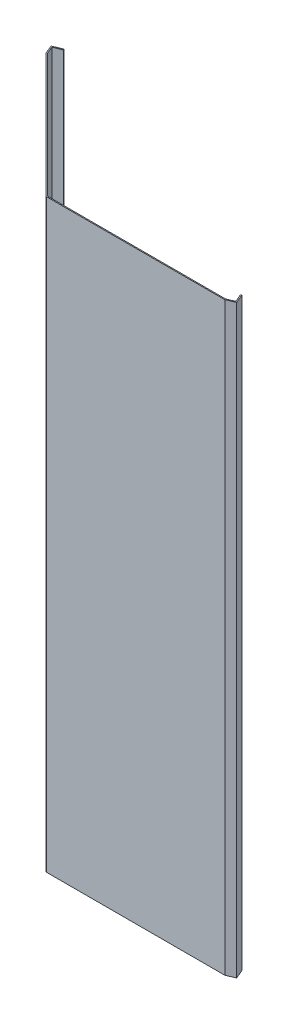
from build123d import *

# Parameters (mm, degrees)
EXTRU_MINCE1_DEPTH      = 2276
CONG_1_R                = 4
CONG_2_R                = 2
ESQUISSE2_W             = 450
ESQUISSE2_H             = 60
ESQUISSE2_W_2           = 430
ESQUISSE2_H_2           = 725.016219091
ENL_V_MAT_EXTRU_1_DEPTH = 2582.864517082


with BuildPart() as part:
    # Esquisse1 → Extru.-Mince1 (new body)
    with BuildSketch(Plane(origin=(0, 0, 0), x_dir=(1, 0, 0), z_dir=(0, 1, 0))):
        Polygon((17.369886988, 48.654773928), (32.217669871, 13.675589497), (0, 0), (-695, 0), (-1179.368145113, 484.368145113), (-1192.479375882, 516.819580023), (-1157.246389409, 531.054630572), (-1155.747963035, 527.345895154), (-1187.27221409, 514.609270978), (-1175.964267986, 486.621122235), (-693.343145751, 4), (-0.813809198, 4), (26.972725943, 15.794684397), (13.687867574, 47.091849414), align=None)
    extrude(amount=EXTRU_MINCE1_DEPTH)

    # Cong_1
    cong_1_edges = [part.edges().sort_by_distance(p)[0] for p in [
        (-695, 1138, 0),
    ]]
    fillet(cong_1_edges, radius=CONG_1_R)

    # Cong_2
    cong_2_edges = [part.edges().sort_by_distance(p)[0] for p in [
        (-693.343145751, 1138, -4),
    ]]
    fillet(cong_2_edges, radius=CONG_2_R)

    # Esquisse2 → Enl_v. mat.-Extru.1 (cut, through all)
    with BuildSketch(Plane(origin=(-347.5, 0, 347.5), x_dir=(0.7071067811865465, 0, 0.7071067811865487), z_dir=(-0.7071067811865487, 0, 0.7071067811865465))):
        with Locations((-836.656882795, 1450)):
            Rectangle(ESQUISSE2_W, ESQUISSE2_H)
        with Locations((-786.656882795, 302.491890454)):
            Rectangle(ESQUISSE2_W_2, ESQUISSE2_H_2)
        with Locations((-836.656882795, 1530)):
            Rectangle(ESQUISSE2_W, ESQUISSE2_H)
        with Locations((-836.656882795, 1610)):
            Rectangle(ESQUISSE2_W, ESQUISSE2_H)
        with Locations((-836.656882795, 1690)):
            Rectangle(ESQUISSE2_W, ESQUISSE2_H)
        with Locations((-836.656882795, 1770)):
            Rectangle(ESQUISSE2_W, ESQUISSE2_H)
    extrude(amount=-ENL_V_MAT_EXTRU_1_DEPTH, mode=Mode.SUBTRACT)


solid = part.part
